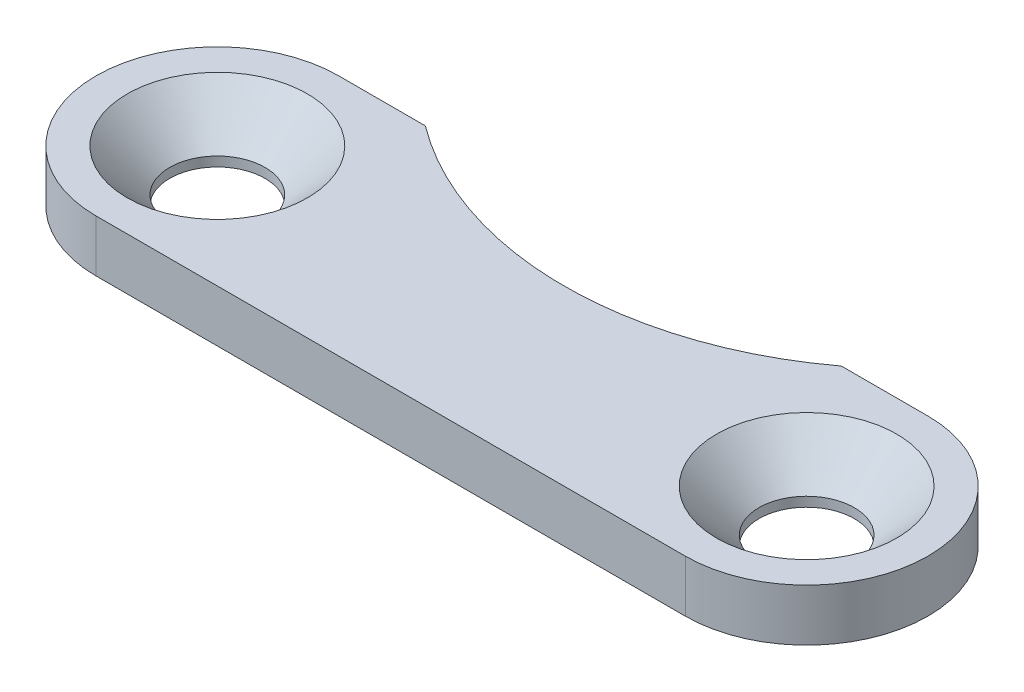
from build123d import *

# Parameters (mm, degrees)
EXTRUDE1_DEPTH                               = 3
CSK_FOR_M5_COUNTERSUNK_FLAT_HEAD_SCR_2_COUNT = 2
CSK_FOR_M5_COUNTERSUNK_FLAT_HEAD_SCR_2_PITCH = 34


with BuildPart() as part:
    # Sketch1 → Extrude1 (new body)
    with BuildSketch(Plane(origin=(0, 0, 0), x_dir=(1, 0, 0), z_dir=(0, 1, 0))):
        with BuildLine():
            Line((17, -7), (-17, -7))
            ThreePointArc((-17, -7), (-24, 0), (-17, 7))
            Line((-17, 7), (-12, 7))
            ThreePointArc((-12, 7), (0, 3), (12, 7))
            Line((12, 7), (17, 7))
            ThreePointArc((17, 7), (24, 0), (17, -7))
        make_face()
    extrude(amount=EXTRUDE1_DEPTH)

    # Sketch3 → CSK for M5 Countersunk Flat Head Screw1 (revolve, cut)
    with BuildSketch(Plane(origin=(-17, 3, 0), x_dir=(0, 0, 1), z_dir=(1, 0, 0))):
        Polygon((0, 0), (0, 3), (2.75, 3), (2.75, 2.45), (5.2, 0), align=None)
    csk_for_m5_countersunk_flat_head_screw1 = revolve(axis=Axis((-17, 9.35, 0), (0, -1, 0)), mode=Mode.SUBTRACT)

    # CSK for M5 Countersunk Flat Head Scr 2: CSK for M5 Countersunk Flat Head Screw1 ×2
    with Locations(*[(i * CSK_FOR_M5_COUNTERSUNK_FLAT_HEAD_SCR_2_PITCH, 0, 0) for i in range(1, CSK_FOR_M5_COUNTERSUNK_FLAT_HEAD_SCR_2_COUNT)]):
        add(csk_for_m5_countersunk_flat_head_screw1, mode=Mode.SUBTRACT)


solid = part.part
